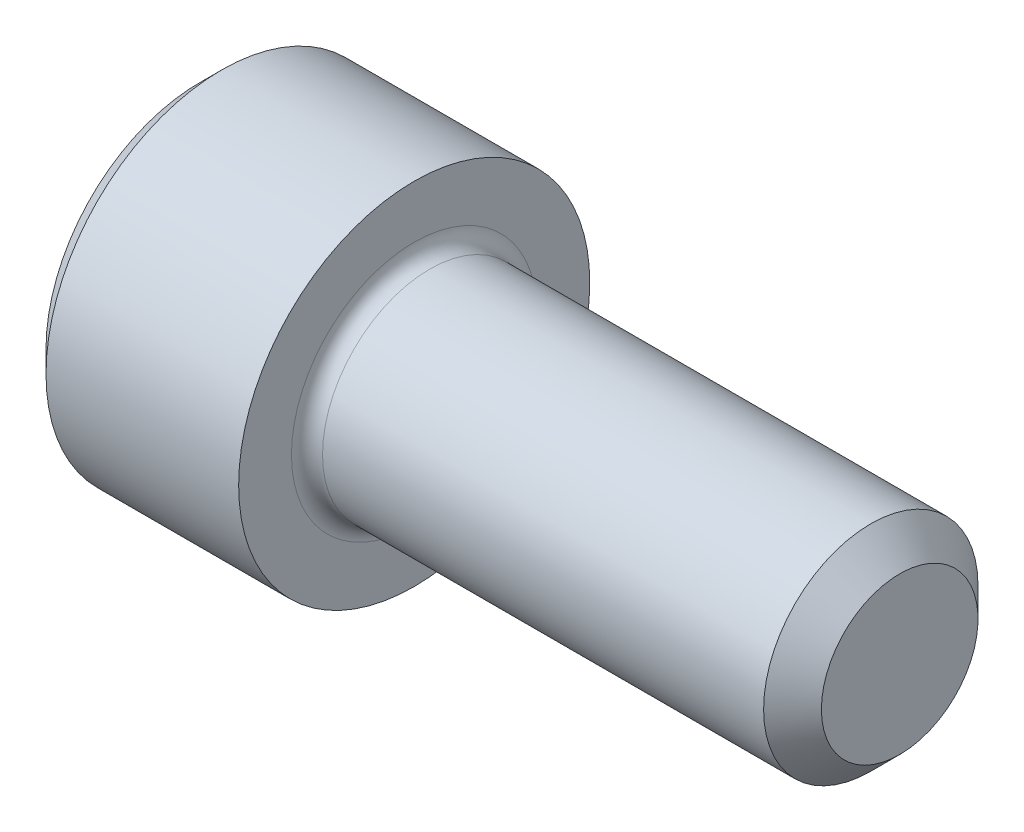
from build123d import *

# Parameters (mm, degrees)
FILLET1_R   = 0.254
HEX_2_DEPTH = 1.6256


with BuildPart() as part:
    # BodySke → Base-Revolve (revolve)
    with BuildSketch(Plane.XY, mode=Mode.PRIVATE) as base_revolve_sk:
        Polygon((0, 0), (0, 2.5146), (0.3556, 2.8702), (3.5052, 2.8702), (3.5052, 1.7526), (10.97026, 1.7526), (11.4427, 1.28016), (11.4427, 0), align=None)
    revolve(base_revolve_sk.sketch.rotate(Axis((-31.75, 0, 0), (1, 0, 0)), 90), axis=Axis((-31.75, 0, 0), (1, 0, 0)))

    # Fillet1
    fillet1_edges = [part.edges().sort_by_distance(p)[0] for p in [
        (3.5052, 0, -1.7526),
    ]]
    fillet(fillet1_edges, radius=FILLET1_R)

    # Sketch2 → Hex-PreBroach (revolve, cut)
    with BuildSketch(Plane.XY, mode=Mode.PRIVATE) as hex_prebroach_sk:
        Polygon((0, 1.3843), (1.6256, 1.3843), (2.424825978, 0), (0, 0), align=None)
    revolve(hex_prebroach_sk.sketch.rotate(Axis((0, 0, 0), (1, 0, 0)), 90), axis=Axis((0, 0, 0), (1, 0, 0)), mode=Mode.SUBTRACT)

    # Sketch3 → Hex 2 (cut)
    with BuildSketch(Plane(origin=(0, 0, 0), x_dir=(0, 0.500000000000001, 0.866025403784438), z_dir=(-1, 0, 0))):
        Polygon((0.799225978, 1.3843), (-0.799225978, 1.3843), (-1.598451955, 0), (-0.799225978, -1.3843), (0.799225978, -1.3843), (1.598451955, 0), align=None)
    extrude(amount=-HEX_2_DEPTH, mode=Mode.SUBTRACT)


solid = part.part
